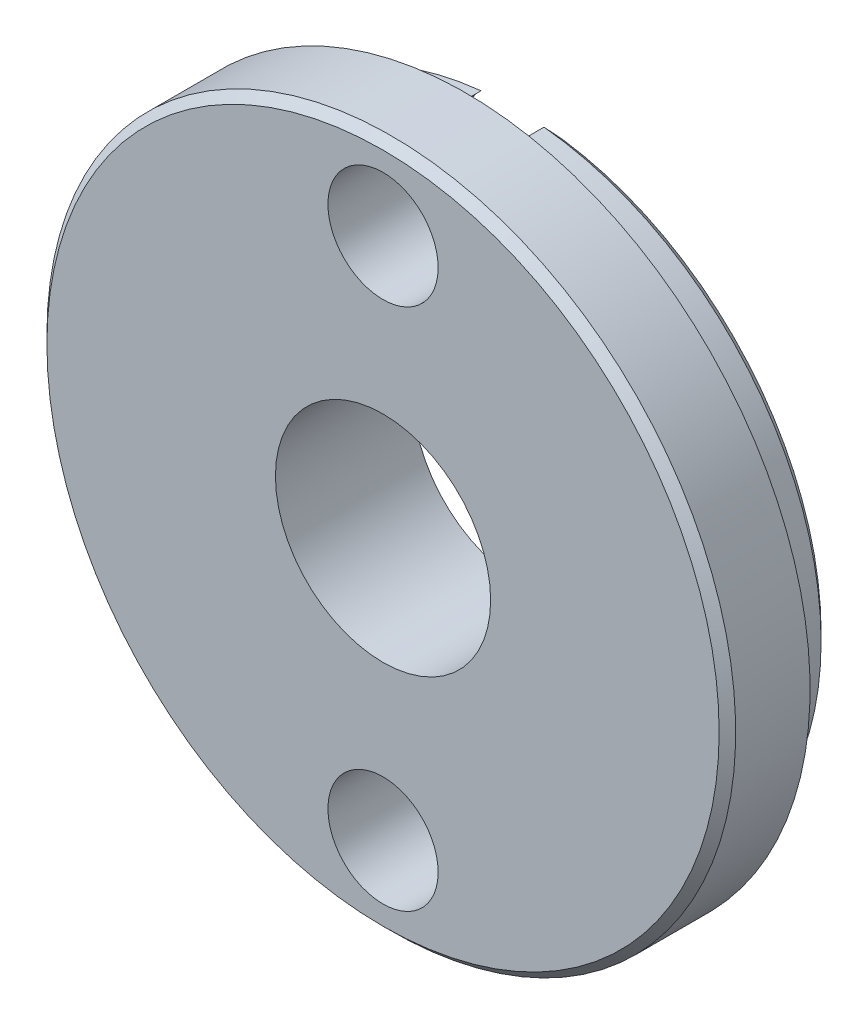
ISO-10303-21;
HEADER;
FILE_DESCRIPTION(('STEP AP214'),'2;1');
FILE_NAME('part.step','',(''),(''),'','','');
FILE_SCHEMA(('AUTOMOTIVE_DESIGN { 1 0 10303 214 1 1 1 1 }'));
ENDSEC;
DATA;
#1=APPLICATION_CONTEXT('core data for automotive mechanical design processes');
#2=APPLICATION_PROTOCOL_DEFINITION('international standard','automotive_design',2000,#1);
#3=PRODUCT_CONTEXT('',#1,'mechanical');
#4=PRODUCT('Part','Part','',(#3));
#5=PRODUCT_RELATED_PRODUCT_CATEGORY('part','',(#4));
#6=PRODUCT_DEFINITION_FORMATION('','',#4);
#7=PRODUCT_DEFINITION_CONTEXT('part definition',#1,'design');
#8=PRODUCT_DEFINITION('design','',#6,#7);
#9=PRODUCT_DEFINITION_SHAPE('','',#8);
#10=(LENGTH_UNIT() NAMED_UNIT(*) SI_UNIT(.MILLI.,.METRE.));
#11=(NAMED_UNIT(*) PLANE_ANGLE_UNIT() SI_UNIT($,.RADIAN.));
#12=(NAMED_UNIT(*) SI_UNIT($,.STERADIAN.) SOLID_ANGLE_UNIT());
#13=UNCERTAINTY_MEASURE_WITH_UNIT(LENGTH_MEASURE(1.E-05),#10,'distance_accuracy_value','');
#14=(GEOMETRIC_REPRESENTATION_CONTEXT(3) GLOBAL_UNCERTAINTY_ASSIGNED_CONTEXT((#13)) GLOBAL_UNIT_ASSIGNED_CONTEXT((#10,
#11,#12)) REPRESENTATION_CONTEXT('',''));
#15=CARTESIAN_POINT('',(0.,0.,0.));
#16=DIRECTION('',(0.,0.,1.));
#17=DIRECTION('',(1.,0.,0.));
#18=AXIS2_PLACEMENT_3D('',#15,#16,#17);
#19=CARTESIAN_POINT('',(0.,0.,-2.54));
#20=DIRECTION('',(0.,0.,1.));
#21=DIRECTION('',(1.,0.,0.));
#22=AXIS2_PLACEMENT_3D('',#19,#20,#21);
#23=CYLINDRICAL_SURFACE('',#22,14.224);
#24=CARTESIAN_POINT('',(0.,0.,0.));
#25=DIRECTION('',(0.,0.,1.));
#26=DIRECTION('',(1.,0.,0.));
#27=AXIS2_PLACEMENT_3D('',#24,#25,#26);
#28=CIRCLE('',#27,14.224);
#29=CARTESIAN_POINT('',(1.45092626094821,14.1498052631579,0.));
#30=VERTEX_POINT('',#29);
#31=CARTESIAN_POINT('',(1.45092626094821,-14.1498052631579,0.));
#32=VERTEX_POINT('',#31);
#33=EDGE_CURVE('E110',#30,#32,#28,.F.);
#34=ORIENTED_EDGE('',*,*,#33,.T.);
#35=DIRECTION('',(0.,0.,1.));
#36=VECTOR('',#35,1.);
#37=CARTESIAN_POINT('',(1.45092626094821,-14.1498052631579,0.635));
#38=LINE('',#37,#36);
#39=CARTESIAN_POINT('',(1.4509262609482,-14.1498052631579,-2.159));
#40=VERTEX_POINT('',#39);
#41=EDGE_CURVE('E104',#32,#40,#38,.F.);
#42=ORIENTED_EDGE('',*,*,#41,.T.);
#43=CARTESIAN_POINT('',(0.,0.,-2.159));
#44=DIRECTION('',(0.,0.,-1.));
#45=DIRECTION('',(-1.,0.,0.));
#46=AXIS2_PLACEMENT_3D('',#43,#44,#45);
#47=CIRCLE('',#46,14.224);
#48=CARTESIAN_POINT('',(1.45092626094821,14.1498052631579,-2.159));
#49=VERTEX_POINT('',#48);
#50=EDGE_CURVE('E112',#40,#49,#47,.F.);
#51=ORIENTED_EDGE('',*,*,#50,.T.);
#52=DIRECTION('',(0.,0.,1.));
#53=VECTOR('',#52,1.);
#54=CARTESIAN_POINT('',(1.45092626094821,14.1498052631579,0.635));
#55=LINE('',#54,#53);
#56=EDGE_CURVE('E180',#49,#30,#55,.T.);
#57=ORIENTED_EDGE('',*,*,#56,.T.);
#58=EDGE_LOOP('',(#34,#42,#51,#57));
#59=FACE_BOUND('',#58,.T.);
#60=ADVANCED_FACE('F36',(#59),#23,.T.);
#61=CARTESIAN_POINT('',(0.,0.,-2.54));
#62=DIRECTION('',(0.,0.,1.));
#63=DIRECTION('',(1.,0.,0.));
#64=AXIS2_PLACEMENT_3D('',#61,#62,#63);
#65=CONICAL_SURFACE('',#64,13.843,0.785398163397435);
#66=CARTESIAN_POINT('',(-1.45058739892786,-14.1500410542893,-2.1588));
#67=CARTESIAN_POINT('',(-1.49773134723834,-14.1172433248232,-2.18661863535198));
#68=CARTESIAN_POINT('',(-1.54328536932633,-14.0831776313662,-2.21559529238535));
#69=CARTESIAN_POINT('',(-1.63099683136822,-14.0129706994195,-2.27551092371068));
#70=CARTESIAN_POINT('',(-1.67316804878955,-13.9768390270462,-2.30644091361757));
#71=CARTESIAN_POINT('',(-1.75429859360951,-13.9026772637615,-2.37014904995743));
#72=CARTESIAN_POINT('',(-1.79325830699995,-13.8646474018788,-2.40292697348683));
#73=CARTESIAN_POINT('',(-1.86815144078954,-13.7867839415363,-2.4702858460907));
#74=CARTESIAN_POINT('',(-1.90407105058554,-13.7469432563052,-2.50487397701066));
#75=CARTESIAN_POINT('',(-1.93839226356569,-13.7064126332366,-2.54020000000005));
#76=B_SPLINE_CURVE_WITH_KNOTS('',3,(#66,#67,#68,#69,#70,#71,#72,#73,#74,#75),.UNSPECIFIED.,.F.,
.F.,(4,2,2,2,4),(0.,0.191370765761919,0.381917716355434,0.572441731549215,0.763789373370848),.UNSPECIFIED.);
#77=CARTESIAN_POINT('',(-1.45092626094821,-14.1498052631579,-2.159));
#78=VERTEX_POINT('',#77);
#79=CARTESIAN_POINT('',(-1.93819792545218,-13.7066421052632,-2.54));
#80=VERTEX_POINT('',#79);
#81=EDGE_CURVE('E11',#78,#80,#76,.T.);
#82=ORIENTED_EDGE('',*,*,#81,.F.);
#83=CARTESIAN_POINT('',(-1.4509262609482,14.1498052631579,-2.159));
#84=VERTEX_POINT('',#83);
#85=EDGE_CURVE('E118',#84,#78,#47,.F.);
#86=ORIENTED_EDGE('',*,*,#85,.F.);
#87=CARTESIAN_POINT('',(-1.93839226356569,13.7064126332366,-2.54020000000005));
#88=CARTESIAN_POINT('',(-1.90407105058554,13.7469432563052,-2.50487397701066));
#89=CARTESIAN_POINT('',(-1.86815144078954,13.7867839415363,-2.4702858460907));
#90=CARTESIAN_POINT('',(-1.79325830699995,13.8646474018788,-2.40292697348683));
#91=CARTESIAN_POINT('',(-1.75429859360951,13.9026772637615,-2.37014904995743));
#92=CARTESIAN_POINT('',(-1.67316804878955,13.9768390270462,-2.30644091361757));
#93=CARTESIAN_POINT('',(-1.63099683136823,14.0129706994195,-2.27551092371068));
#94=CARTESIAN_POINT('',(-1.54328536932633,14.0831776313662,-2.21559529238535));
#95=CARTESIAN_POINT('',(-1.49773134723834,14.1172433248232,-2.18661863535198));
#96=CARTESIAN_POINT('',(-1.45058739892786,14.1500410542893,-2.1588));
#97=B_SPLINE_CURVE_WITH_KNOTS('',3,(#87,#88,#89,#90,#91,#92,#93,#94,#95,#96),.UNSPECIFIED.,.F.,
.F.,(4,2,2,2,4),(0.,0.191347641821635,0.381871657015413,0.572418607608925,0.763789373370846),.UNSPECIFIED.);
#98=CARTESIAN_POINT('',(-1.93819792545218,13.7066421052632,-2.54));
#99=VERTEX_POINT('',#98);
#100=EDGE_CURVE('E109',#99,#84,#97,.T.);
#101=ORIENTED_EDGE('',*,*,#100,.F.);
#102=CARTESIAN_POINT('',(0.,0.,-2.54));
#103=DIRECTION('',(0.,0.,-1.));
#104=DIRECTION('',(-1.,0.,0.));
#105=AXIS2_PLACEMENT_3D('',#102,#103,#104);
#106=CIRCLE('',#105,13.843);
#107=EDGE_CURVE('E62',#80,#99,#106,.T.);
#108=ORIENTED_EDGE('',*,*,#107,.F.);
#109=EDGE_LOOP('',(#82,#86,#101,#108));
#110=FACE_BOUND('',#109,.T.);
#111=ADVANCED_FACE('F108',(#110),#65,.T.);
#112=CARTESIAN_POINT('',(0.,0.,0.));
#113=DIRECTION('',(0.,0.,1.));
#114=DIRECTION('',(1.,0.,0.));
#115=AXIS2_PLACEMENT_3D('',#112,#113,#114);
#116=PLANE('',#115);
#117=CARTESIAN_POINT('',(0.,0.,0.));
#118=DIRECTION('',(0.,0.,1.));
#119=DIRECTION('',(1.,0.,0.));
#120=AXIS2_PLACEMENT_3D('',#117,#118,#119);
#121=CIRCLE('',#120,15.875);
#122=CARTESIAN_POINT('',(-15.875,0.,0.));
#123=VERTEX_POINT('',#122);
#124=EDGE_CURVE('E207',#123,#123,#121,.T.);
#125=ORIENTED_EDGE('',*,*,#124,.F.);
#126=EDGE_LOOP('',(#125));
#127=FACE_BOUND('',#126,.T.);
#128=CARTESIAN_POINT('',(-1.45092626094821,-14.1498052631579,0.));
#129=VERTEX_POINT('',#128);
#130=CARTESIAN_POINT('',(-1.45092626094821,14.1498052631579,0.));
#131=VERTEX_POINT('',#130);
#132=EDGE_CURVE('E114',#129,#131,#28,.F.);
#133=ORIENTED_EDGE('',*,*,#132,.F.);
#134=CARTESIAN_POINT('',(0.,-12.065,0.));
#135=DIRECTION('',(0.,0.,1.));
#136=DIRECTION('',(1.,0.,0.));
#137=AXIS2_PLACEMENT_3D('',#134,#135,#136);
#138=CIRCLE('',#137,2.54);
#139=EDGE_CURVE('E186',#129,#32,#138,.T.);
#140=ORIENTED_EDGE('',*,*,#139,.T.);
#141=ORIENTED_EDGE('',*,*,#33,.F.);
#142=CARTESIAN_POINT('',(0.,12.065,0.));
#143=DIRECTION('',(0.,0.,1.));
#144=DIRECTION('',(1.,0.,0.));
#145=AXIS2_PLACEMENT_3D('',#142,#143,#144);
#146=CIRCLE('',#145,2.54);
#147=EDGE_CURVE('E185',#30,#131,#146,.T.);
#148=ORIENTED_EDGE('',*,*,#147,.T.);
#149=EDGE_LOOP('',(#133,#140,#141,#148));
#150=FACE_BOUND('',#149,.T.);
#151=ADVANCED_FACE('F162',(#127,#150),#116,.F.);
#152=CARTESIAN_POINT('',(0.,0.,3.81));
#153=DIRECTION('',(0.,0.,-1.));
#154=DIRECTION('',(-1.,0.,0.));
#155=AXIS2_PLACEMENT_3D('',#152,#153,#154);
#156=CYLINDRICAL_SURFACE('',#155,15.875);
#157=CARTESIAN_POINT('',(0.,0.,3.42900000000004));
#158=DIRECTION('',(0.,0.,1.));
#159=DIRECTION('',(1.,0.,0.));
#160=AXIS2_PLACEMENT_3D('',#157,#158,#159);
#161=CIRCLE('',#160,15.875);
#162=CARTESIAN_POINT('',(-15.875,0.,3.42900000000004));
#163=VERTEX_POINT('',#162);
#164=EDGE_CURVE('E123',#163,#163,#161,.F.);
#165=CARTESIAN_POINT('',(-15.875,0.,3.42900000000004));
#166=CARTESIAN_POINT('',(-15.875,0.,3.39328125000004));
#167=CARTESIAN_POINT('',(-15.875,0.,3.35756250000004));
#168=CARTESIAN_POINT('',(-15.875,0.,3.28612500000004));
#169=CARTESIAN_POINT('',(-15.875,0.,3.25040625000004));
#170=CARTESIAN_POINT('',(-15.875,0.,3.17896875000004));
#171=CARTESIAN_POINT('',(-15.875,0.,3.14325000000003));
#172=CARTESIAN_POINT('',(-15.875,0.,3.07181250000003));
#173=CARTESIAN_POINT('',(-15.875,0.,3.03609375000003));
#174=CARTESIAN_POINT('',(-15.875,0.,2.96465625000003));
#175=CARTESIAN_POINT('',(-15.875,0.,2.92893750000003));
#176=CARTESIAN_POINT('',(-15.875,0.,2.85750000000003));
#177=CARTESIAN_POINT('',(-15.875,0.,2.82178125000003));
#178=CARTESIAN_POINT('',(-15.875,0.,2.75034375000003));
#179=CARTESIAN_POINT('',(-15.875,0.,2.71462500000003));
#180=CARTESIAN_POINT('',(-15.875,0.,2.64318750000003));
#181=CARTESIAN_POINT('',(-15.875,0.,2.60746875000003));
#182=CARTESIAN_POINT('',(-15.875,0.,2.53603125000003));
#183=CARTESIAN_POINT('',(-15.875,0.,2.50031250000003));
#184=CARTESIAN_POINT('',(-15.875,0.,2.42887500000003));
#185=CARTESIAN_POINT('',(-15.875,0.,2.39315625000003));
#186=CARTESIAN_POINT('',(-15.875,0.,2.32171875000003));
#187=CARTESIAN_POINT('',(-15.875,0.,2.28600000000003));
#188=CARTESIAN_POINT('',(-15.875,0.,2.21456250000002));
#189=CARTESIAN_POINT('',(-15.875,0.,2.17884375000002));
#190=CARTESIAN_POINT('',(-15.875,0.,2.10740625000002));
#191=CARTESIAN_POINT('',(-15.875,0.,2.07168750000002));
#192=CARTESIAN_POINT('',(-15.875,0.,2.00025000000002));
#193=CARTESIAN_POINT('',(-15.875,0.,1.96453125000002));
#194=CARTESIAN_POINT('',(-15.875,0.,1.89309375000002));
#195=CARTESIAN_POINT('',(-15.875,0.,1.85737500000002));
#196=CARTESIAN_POINT('',(-15.875,0.,1.78593750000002));
#197=CARTESIAN_POINT('',(-15.875,0.,1.75021875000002));
#198=CARTESIAN_POINT('',(-15.875,0.,1.67878125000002));
#199=CARTESIAN_POINT('',(-15.875,0.,1.64306250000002));
#200=CARTESIAN_POINT('',(-15.875,0.,1.57162500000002));
#201=CARTESIAN_POINT('',(-15.875,0.,1.53590625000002));
#202=CARTESIAN_POINT('',(-15.875,0.,1.46446875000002));
#203=CARTESIAN_POINT('',(-15.875,0.,1.42875000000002));
#204=CARTESIAN_POINT('',(-15.875,0.,1.35731250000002));
#205=CARTESIAN_POINT('',(-15.875,0.,1.32159375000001));
#206=CARTESIAN_POINT('',(-15.875,0.,1.25015625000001));
#207=CARTESIAN_POINT('',(-15.875,0.,1.21443750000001));
#208=CARTESIAN_POINT('',(-15.875,0.,1.14300000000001));
#209=CARTESIAN_POINT('',(-15.875,0.,1.10728125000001));
#210=CARTESIAN_POINT('',(-15.875,0.,1.03584375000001));
#211=CARTESIAN_POINT('',(-15.875,0.,1.00012500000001));
#212=CARTESIAN_POINT('',(-15.875,0.,0.92868750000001));
#213=CARTESIAN_POINT('',(-15.875,0.,0.89296875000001));
#214=CARTESIAN_POINT('',(-15.875,0.,0.821531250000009));
#215=CARTESIAN_POINT('',(-15.875,0.,0.785812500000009));
#216=CARTESIAN_POINT('',(-15.875,0.,0.714375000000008));
#217=CARTESIAN_POINT('',(-15.875,0.,0.678656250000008));
#218=CARTESIAN_POINT('',(-15.875,0.,0.607218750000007));
#219=CARTESIAN_POINT('',(-15.875,0.,0.571500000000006));
#220=CARTESIAN_POINT('',(-15.875,0.,0.500062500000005));
#221=CARTESIAN_POINT('',(-15.875,0.,0.464343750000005));
#222=CARTESIAN_POINT('',(-15.875,0.,0.392906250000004));
#223=CARTESIAN_POINT('',(-15.875,0.,0.357187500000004));
#224=CARTESIAN_POINT('',(-15.875,0.,0.285750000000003));
#225=CARTESIAN_POINT('',(-15.875,0.,0.250031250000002));
#226=CARTESIAN_POINT('',(-15.875,0.,0.178593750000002));
#227=CARTESIAN_POINT('',(-15.875,0.,0.142875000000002));
#228=CARTESIAN_POINT('',(-15.875,0.,0.0714375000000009));
#229=CARTESIAN_POINT('',(-15.875,0.,0.0357187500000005));
#230=CARTESIAN_POINT('',(-15.875,0.,0.));
#231=B_SPLINE_CURVE_WITH_KNOTS('',3,(#165,#166,#167,#168,#169,#170,#171,#172,#173,#174,#175,
#176,#177,#178,#179,#180,#181,#182,#183,#184,#185,#186,#187,#188,#189,#190,#191,#192,#193,#194,
#195,#196,#197,#198,#199,#200,#201,#202,#203,#204,#205,#206,#207,#208,#209,#210,#211,#212,#213,
#214,#215,#216,#217,#218,#219,#220,#221,#222,#223,#224,#225,#226,#227,#228,#229,#230),
.UNSPECIFIED.,.F.,.F.,(4,2,2,2,2,2,2,2,2,2,2,2,2,2,2,2,2,2,2,2,2,2,2,2,2,2,2,2,2,2,2,2,4),(0.,
0.107156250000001,0.214312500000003,0.321468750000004,0.428625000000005,0.535781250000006,
0.642937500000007,0.750093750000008,0.85725000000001,0.964406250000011,1.07156250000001,
1.17871875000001,1.28587500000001,1.39303125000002,1.50018750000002,1.60734375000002,
1.71450000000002,1.82165625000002,1.92881250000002,2.03596875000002,2.14312500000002,
2.25028125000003,2.35743750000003,2.46459375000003,2.57175000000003,2.67890625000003,
2.78606250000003,2.89321875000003,3.00037500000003,3.10753125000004,3.21468750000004,
3.32184375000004,3.42900000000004),.UNSPECIFIED.);
#232=EDGE_CURVE('BSEAM160',#163,#123,#231,.T.);
#233=ORIENTED_EDGE('',*,*,#164,.T.);
#234=ORIENTED_EDGE('',*,*,#124,.T.);
#235=ORIENTED_EDGE('',*,*,#232,.T.);
#236=ORIENTED_EDGE('',*,*,#232,.F.);
#237=EDGE_LOOP('',(#233,#235,#234,#236));
#238=FACE_BOUND('',#237,.T.);
#239=ADVANCED_FACE('F160',(#238),#156,.T.);
#240=CARTESIAN_POINT('',(0.,0.,3.81));
#241=DIRECTION('',(0.,0.,1.));
#242=DIRECTION('',(1.,0.,0.));
#243=AXIS2_PLACEMENT_3D('',#240,#241,#242);
#244=PLANE('',#243);
#245=CARTESIAN_POINT('',(0.,-12.065,3.81));
#246=DIRECTION('',(0.,0.,1.));
#247=DIRECTION('',(1.,0.,0.));
#248=AXIS2_PLACEMENT_3D('',#245,#246,#247);
#249=CIRCLE('',#248,2.54);
#250=CARTESIAN_POINT('',(2.54,-12.065,3.81));
#251=VERTEX_POINT('',#250);
#252=EDGE_CURVE('E105',#251,#251,#249,.T.);
#253=ORIENTED_EDGE('',*,*,#252,.F.);
#254=EDGE_LOOP('',(#253));
#255=FACE_BOUND('',#254,.T.);
#256=CARTESIAN_POINT('',(0.,12.065,3.81));
#257=DIRECTION('',(0.,0.,1.));
#258=DIRECTION('',(1.,0.,0.));
#259=AXIS2_PLACEMENT_3D('',#256,#257,#258);
#260=CIRCLE('',#259,2.54);
#261=CARTESIAN_POINT('',(2.54,12.065,3.81));
#262=VERTEX_POINT('',#261);
#263=EDGE_CURVE('E188',#262,#262,#260,.T.);
#264=ORIENTED_EDGE('',*,*,#263,.F.);
#265=EDGE_LOOP('',(#264));
#266=FACE_BOUND('',#265,.T.);
#267=CARTESIAN_POINT('',(0.,0.,3.81));
#268=DIRECTION('',(0.,0.,1.));
#269=DIRECTION('',(1.,0.,0.));
#270=AXIS2_PLACEMENT_3D('',#267,#268,#269);
#271=CIRCLE('',#270,15.494);
#272=CARTESIAN_POINT('',(15.494,0.,3.81));
#273=VERTEX_POINT('',#272);
#274=EDGE_CURVE('E120',#273,#273,#271,.T.);
#275=ORIENTED_EDGE('',*,*,#274,.T.);
#276=EDGE_LOOP('',(#275));
#277=FACE_BOUND('',#276,.T.);
#278=CARTESIAN_POINT('',(0.,0.,3.81));
#279=DIRECTION('',(0.,0.,1.));
#280=DIRECTION('',(1.,0.,0.));
#281=AXIS2_PLACEMENT_3D('',#278,#279,#280);
#282=CIRCLE('',#281,4.96061999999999);
#283=CARTESIAN_POINT('',(4.96061999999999,0.,3.81));
#284=VERTEX_POINT('',#283);
#285=EDGE_CURVE('E202',#284,#284,#282,.T.);
#286=ORIENTED_EDGE('',*,*,#285,.F.);
#287=EDGE_LOOP('',(#286));
#288=FACE_BOUND('',#287,.T.);
#289=ADVANCED_FACE('F156',(#255,#266,#277,#288),#244,.T.);
#290=ORIENTED_EDGE('',*,*,#85,.T.);
#291=DIRECTION('',(0.,0.,1.));
#292=VECTOR('',#291,1.);
#293=CARTESIAN_POINT('',(-1.45092626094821,-14.1498052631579,0.635));
#294=LINE('',#293,#292);
#295=EDGE_CURVE('E95',#78,#129,#294,.T.);
#296=ORIENTED_EDGE('',*,*,#295,.T.);
#297=ORIENTED_EDGE('',*,*,#132,.T.);
#298=DIRECTION('',(0.,0.,1.));
#299=VECTOR('',#298,1.);
#300=CARTESIAN_POINT('',(-1.45092626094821,14.1498052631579,0.635));
#301=LINE('',#300,#299);
#302=EDGE_CURVE('E195',#131,#84,#301,.F.);
#303=ORIENTED_EDGE('',*,*,#302,.T.);
#304=EDGE_LOOP('',(#290,#296,#297,#303));
#305=FACE_BOUND('',#304,.T.);
#306=ADVANCED_FACE('F153',(#305),#23,.T.);
#307=CARTESIAN_POINT('',(0.,0.,-2.54));
#308=DIRECTION('',(0.,0.,-1.));
#309=DIRECTION('',(-1.,0.,0.));
#310=AXIS2_PLACEMENT_3D('',#307,#308,#309);
#311=PLANE('',#310);
#312=CARTESIAN_POINT('',(0.,-12.065,-2.54));
#313=DIRECTION('',(0.,0.,1.));
#314=DIRECTION('',(1.,0.,0.));
#315=AXIS2_PLACEMENT_3D('',#312,#313,#314);
#316=CIRCLE('',#315,2.54);
#317=CARTESIAN_POINT('',(1.93819792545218,-13.7066421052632,-2.54));
#318=VERTEX_POINT('',#317);
#319=EDGE_CURVE('E55',#318,#80,#316,.T.);
#320=ORIENTED_EDGE('',*,*,#319,.T.);
#321=ORIENTED_EDGE('',*,*,#107,.T.);
#322=CARTESIAN_POINT('',(0.,12.065,-2.54));
#323=DIRECTION('',(0.,0.,1.));
#324=DIRECTION('',(1.,0.,0.));
#325=AXIS2_PLACEMENT_3D('',#322,#323,#324);
#326=CIRCLE('',#325,2.54);
#327=CARTESIAN_POINT('',(1.93819792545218,13.7066421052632,-2.54));
#328=VERTEX_POINT('',#327);
#329=EDGE_CURVE('E193',#99,#328,#326,.T.);
#330=ORIENTED_EDGE('',*,*,#329,.T.);
#331=EDGE_CURVE('E103',#328,#318,#106,.T.);
#332=ORIENTED_EDGE('',*,*,#331,.T.);
#333=EDGE_LOOP('',(#320,#321,#330,#332));
#334=FACE_BOUND('',#333,.T.);
#335=CARTESIAN_POINT('',(0.,0.,-2.54));
#336=DIRECTION('',(0.,0.,1.));
#337=DIRECTION('',(1.,0.,0.));
#338=AXIS2_PLACEMENT_3D('',#335,#336,#337);
#339=CIRCLE('',#338,4.96062);
#340=CARTESIAN_POINT('',(4.96062,0.,-2.54));
#341=VERTEX_POINT('',#340);
#342=EDGE_CURVE('E205',#341,#341,#339,.T.);
#343=ORIENTED_EDGE('',*,*,#342,.T.);
#344=EDGE_LOOP('',(#343));
#345=FACE_BOUND('',#344,.T.);
#346=ADVANCED_FACE('F100',(#334,#345),#311,.T.);
#347=CARTESIAN_POINT('',(0.,0.,3.81));
#348=DIRECTION('',(0.,0.,1.));
#349=DIRECTION('',(1.,0.,0.));
#350=AXIS2_PLACEMENT_3D('',#347,#348,#349);
#351=CYLINDRICAL_SURFACE('',#350,4.96061999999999);
#352=ORIENTED_EDGE('',*,*,#342,.F.);
#353=EDGE_LOOP('',(#352));
#354=FACE_BOUND('',#353,.T.);
#355=ORIENTED_EDGE('',*,*,#285,.T.);
#356=EDGE_LOOP('',(#355));
#357=FACE_BOUND('',#356,.T.);
#358=ADVANCED_FACE('F146',(#354,#357),#351,.F.);
#359=CARTESIAN_POINT('',(1.93839226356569,-13.7064126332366,-2.54020000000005));
#360=CARTESIAN_POINT('',(1.90407105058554,-13.7469432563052,-2.50487397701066));
#361=CARTESIAN_POINT('',(1.86815144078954,-13.7867839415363,-2.4702858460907));
#362=CARTESIAN_POINT('',(1.79325830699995,-13.8646474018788,-2.40292697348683));
#363=CARTESIAN_POINT('',(1.75429859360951,-13.9026772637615,-2.37014904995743));
#364=CARTESIAN_POINT('',(1.67316804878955,-13.9768390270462,-2.30644091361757));
#365=CARTESIAN_POINT('',(1.63099683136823,-14.0129706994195,-2.27551092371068));
#366=CARTESIAN_POINT('',(1.54328536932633,-14.0831776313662,-2.21559529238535));
#367=CARTESIAN_POINT('',(1.49773134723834,-14.1172433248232,-2.18661863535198));
#368=CARTESIAN_POINT('',(1.45058739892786,-14.1500410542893,-2.1588));
#369=B_SPLINE_CURVE_WITH_KNOTS('',3,(#359,#360,#361,#362,#363,#364,#365,#366,#367,#368),
.UNSPECIFIED.,.F.,.F.,(4,2,2,2,4),(0.,0.191347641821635,0.381871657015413,0.572418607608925,
0.763789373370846),.UNSPECIFIED.);
#370=EDGE_CURVE('E49',#318,#40,#369,.T.);
#371=ORIENTED_EDGE('',*,*,#370,.F.);
#372=ORIENTED_EDGE('',*,*,#331,.F.);
#373=CARTESIAN_POINT('',(1.45058739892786,14.1500410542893,-2.1588));
#374=CARTESIAN_POINT('',(1.49773134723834,14.1172433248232,-2.18661863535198));
#375=CARTESIAN_POINT('',(1.54328536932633,14.0831776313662,-2.21559529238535));
#376=CARTESIAN_POINT('',(1.63099683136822,14.0129706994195,-2.27551092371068));
#377=CARTESIAN_POINT('',(1.67316804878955,13.9768390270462,-2.30644091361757));
#378=CARTESIAN_POINT('',(1.75429859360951,13.9026772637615,-2.37014904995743));
#379=CARTESIAN_POINT('',(1.79325830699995,13.8646474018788,-2.40292697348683));
#380=CARTESIAN_POINT('',(1.86815144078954,13.7867839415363,-2.4702858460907));
#381=CARTESIAN_POINT('',(1.90407105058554,13.7469432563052,-2.50487397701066));
#382=CARTESIAN_POINT('',(1.93839226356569,13.7064126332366,-2.54020000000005));
#383=B_SPLINE_CURVE_WITH_KNOTS('',3,(#373,#374,#375,#376,#377,#378,#379,#380,#381,#382),
.UNSPECIFIED.,.F.,.F.,(4,2,2,2,4),(0.,0.191370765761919,0.381917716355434,0.572441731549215,
0.763789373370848),.UNSPECIFIED.);
#384=EDGE_CURVE('E132',#49,#328,#383,.T.);
#385=ORIENTED_EDGE('',*,*,#384,.F.);
#386=ORIENTED_EDGE('',*,*,#50,.F.);
#387=EDGE_LOOP('',(#371,#372,#385,#386));
#388=FACE_BOUND('',#387,.T.);
#389=ADVANCED_FACE('F137',(#388),#65,.T.);
#390=CARTESIAN_POINT('',(0.,0.,3.81));
#391=DIRECTION('',(0.,0.,-1.));
#392=DIRECTION('',(-1.,0.,0.));
#393=AXIS2_PLACEMENT_3D('',#390,#391,#392);
#394=CONICAL_SURFACE('',#393,15.494,0.785398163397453);
#395=ORIENTED_EDGE('',*,*,#164,.F.);
#396=EDGE_LOOP('',(#395));
#397=FACE_BOUND('',#396,.T.);
#398=ORIENTED_EDGE('',*,*,#274,.F.);
#399=EDGE_LOOP('',(#398));
#400=FACE_BOUND('',#399,.T.);
#401=ADVANCED_FACE('F38',(#397,#400),#394,.T.);
#402=CARTESIAN_POINT('',(0.,12.065,-2.54));
#403=DIRECTION('',(0.,0.,1.));
#404=DIRECTION('',(1.,0.,0.));
#405=AXIS2_PLACEMENT_3D('',#402,#403,#404);
#406=CYLINDRICAL_SURFACE('',#405,2.54);
#407=ORIENTED_EDGE('',*,*,#384,.T.);
#408=ORIENTED_EDGE('',*,*,#329,.F.);
#409=ORIENTED_EDGE('',*,*,#100,.T.);
#410=ORIENTED_EDGE('',*,*,#302,.F.);
#411=ORIENTED_EDGE('',*,*,#147,.F.);
#412=ORIENTED_EDGE('',*,*,#56,.F.);
#413=EDGE_LOOP('',(#407,#408,#409,#410,#411,#412));
#414=FACE_BOUND('',#413,.T.);
#415=ORIENTED_EDGE('',*,*,#263,.T.);
#416=EDGE_LOOP('',(#415));
#417=FACE_BOUND('',#416,.T.);
#418=ADVANCED_FACE('F140',(#414,#417),#406,.F.);
#419=CARTESIAN_POINT('',(0.,-12.065,-2.54));
#420=DIRECTION('',(0.,0.,1.));
#421=DIRECTION('',(1.,0.,0.));
#422=AXIS2_PLACEMENT_3D('',#419,#420,#421);
#423=CYLINDRICAL_SURFACE('',#422,2.54);
#424=ORIENTED_EDGE('',*,*,#81,.T.);
#425=ORIENTED_EDGE('',*,*,#319,.F.);
#426=ORIENTED_EDGE('',*,*,#370,.T.);
#427=ORIENTED_EDGE('',*,*,#41,.F.);
#428=ORIENTED_EDGE('',*,*,#139,.F.);
#429=ORIENTED_EDGE('',*,*,#295,.F.);
#430=EDGE_LOOP('',(#424,#425,#426,#427,#428,#429));
#431=FACE_BOUND('',#430,.T.);
#432=ORIENTED_EDGE('',*,*,#252,.T.);
#433=EDGE_LOOP('',(#432));
#434=FACE_BOUND('',#433,.T.);
#435=ADVANCED_FACE('F92',(#431,#434),#423,.F.);
#436=CLOSED_SHELL('',(#60,#111,#151,#239,#289,#306,#346,#358,#389,#401,#418,#435));
#437=MANIFOLD_SOLID_BREP('B2',#436);
#438=ADVANCED_BREP_SHAPE_REPRESENTATION('',(#18,#437),#14);
#439=SHAPE_DEFINITION_REPRESENTATION(#9,#438);
ENDSEC;
END-ISO-10303-21;
